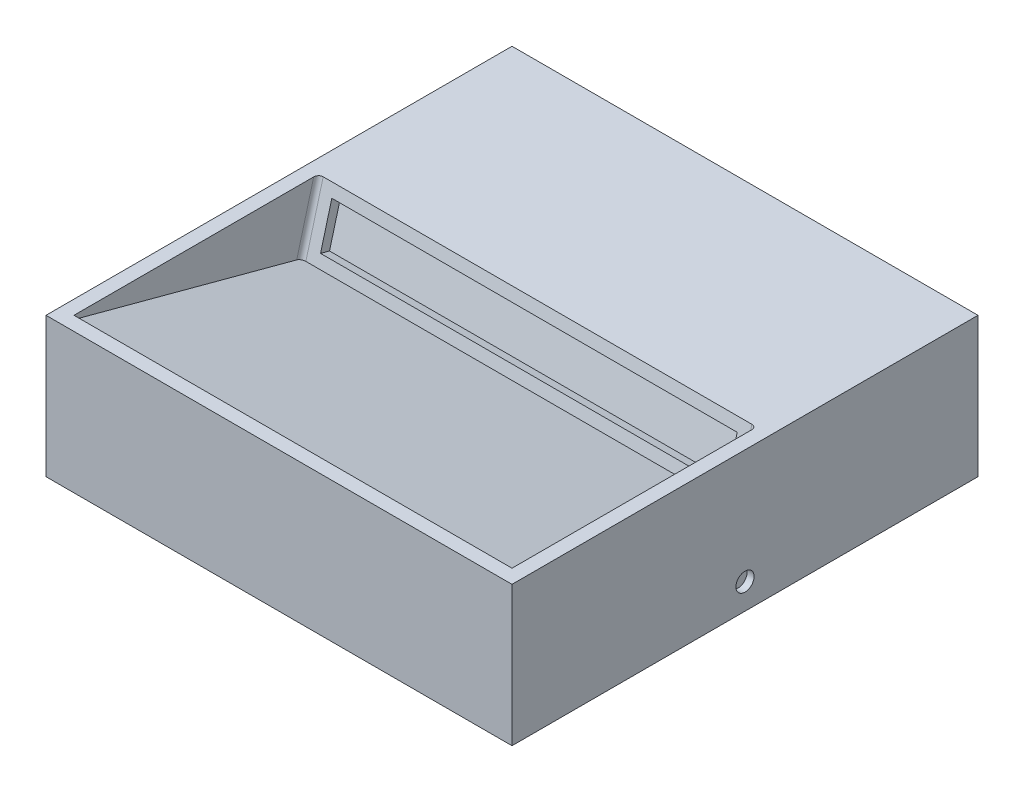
ISO-10303-21;
HEADER;
FILE_DESCRIPTION(('STEP AP214'),'2;1');
FILE_NAME('part.step','',(''),(''),'','','');
FILE_SCHEMA(('AUTOMOTIVE_DESIGN { 1 0 10303 214 1 1 1 1 }'));
ENDSEC;
DATA;
#1=APPLICATION_CONTEXT('core data for automotive mechanical design processes');
#2=APPLICATION_PROTOCOL_DEFINITION('international standard','automotive_design',2000,#1);
#3=PRODUCT_CONTEXT('',#1,'mechanical');
#4=PRODUCT('Part','Part','',(#3));
#5=PRODUCT_RELATED_PRODUCT_CATEGORY('part','',(#4));
#6=PRODUCT_DEFINITION_FORMATION('','',#4);
#7=PRODUCT_DEFINITION_CONTEXT('part definition',#1,'design');
#8=PRODUCT_DEFINITION('design','',#6,#7);
#9=PRODUCT_DEFINITION_SHAPE('','',#8);
#10=(LENGTH_UNIT() NAMED_UNIT(*) SI_UNIT(.MILLI.,.METRE.));
#11=(NAMED_UNIT(*) PLANE_ANGLE_UNIT() SI_UNIT($,.RADIAN.));
#12=(NAMED_UNIT(*) SI_UNIT($,.STERADIAN.) SOLID_ANGLE_UNIT());
#13=UNCERTAINTY_MEASURE_WITH_UNIT(LENGTH_MEASURE(1.E-05),#10,'distance_accuracy_value','');
#14=(GEOMETRIC_REPRESENTATION_CONTEXT(3) GLOBAL_UNCERTAINTY_ASSIGNED_CONTEXT((#13)) GLOBAL_UNIT_ASSIGNED_CONTEXT((#10,
#11,#12)) REPRESENTATION_CONTEXT('',''));
#15=CARTESIAN_POINT('',(0.,0.,0.));
#16=DIRECTION('',(0.,0.,1.));
#17=DIRECTION('',(1.,0.,0.));
#18=AXIS2_PLACEMENT_3D('',#15,#16,#17);
#19=CARTESIAN_POINT('',(100.,30.,-100.));
#20=DIRECTION('',(-1.,0.,0.));
#21=DIRECTION('',(0.,0.,1.));
#22=AXIS2_PLACEMENT_3D('',#19,#20,#21);
#23=PLANE('',#22);
#24=DIRECTION('',(0.,0.,-1.));
#25=VECTOR('',#24,1.);
#26=CARTESIAN_POINT('',(100.,0.,-100.));
#27=LINE('',#26,#25);
#28=CARTESIAN_POINT('',(100.,0.,0.));
#29=VERTEX_POINT('',#28);
#30=CARTESIAN_POINT('',(100.,0.,-100.));
#31=VERTEX_POINT('',#30);
#32=EDGE_CURVE('E546',#29,#31,#27,.T.);
#33=ORIENTED_EDGE('',*,*,#32,.T.);
#34=DIRECTION('',(0.,-1.,0.));
#35=VECTOR('',#34,1.);
#36=CARTESIAN_POINT('',(100.,30.,-100.));
#37=LINE('',#36,#35);
#38=CARTESIAN_POINT('',(100.,30.,-100.));
#39=VERTEX_POINT('',#38);
#40=EDGE_CURVE('E561',#39,#31,#37,.T.);
#41=ORIENTED_EDGE('',*,*,#40,.F.);
#42=DIRECTION('',(0.,0.,-1.));
#43=VECTOR('',#42,1.);
#44=CARTESIAN_POINT('',(100.,30.,-100.));
#45=LINE('',#44,#43);
#46=CARTESIAN_POINT('',(100.,30.,0.));
#47=VERTEX_POINT('',#46);
#48=EDGE_CURVE('E532',#47,#39,#45,.T.);
#49=ORIENTED_EDGE('',*,*,#48,.F.);
#50=DIRECTION('',(0.,-1.,0.));
#51=VECTOR('',#50,1.);
#52=CARTESIAN_POINT('',(100.,30.,0.));
#53=LINE('',#52,#51);
#54=EDGE_CURVE('E565',#47,#29,#53,.T.);
#55=ORIENTED_EDGE('',*,*,#54,.T.);
#56=EDGE_LOOP('',(#33,#41,#49,#55));
#57=FACE_BOUND('',#56,.T.);
#58=CARTESIAN_POINT('',(100.,5.5,-50.));
#59=DIRECTION('',(1.,0.,0.));
#60=DIRECTION('',(0.,0.,-1.));
#61=AXIS2_PLACEMENT_3D('',#58,#59,#60);
#62=CIRCLE('',#61,1.94999999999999);
#63=CARTESIAN_POINT('',(100.,5.5,-51.95));
#64=VERTEX_POINT('',#63);
#65=EDGE_CURVE('E260',#64,#64,#62,.T.);
#66=ORIENTED_EDGE('',*,*,#65,.F.);
#67=EDGE_LOOP('',(#66));
#68=FACE_BOUND('',#67,.T.);
#69=ADVANCED_FACE('F41',(#57,#68),#23,.F.);
#70=CARTESIAN_POINT('',(0.,30.,0.));
#71=DIRECTION('',(1.,0.,0.));
#72=DIRECTION('',(0.,0.,-1.));
#73=AXIS2_PLACEMENT_3D('',#70,#71,#72);
#74=PLANE('',#73);
#75=DIRECTION('',(0.,0.,1.));
#76=VECTOR('',#75,1.);
#77=CARTESIAN_POINT('',(0.,0.,0.));
#78=LINE('',#77,#76);
#79=CARTESIAN_POINT('',(0.,0.,-100.));
#80=VERTEX_POINT('',#79);
#81=CARTESIAN_POINT('',(0.,0.,0.));
#82=VERTEX_POINT('',#81);
#83=EDGE_CURVE('E533',#80,#82,#78,.T.);
#84=ORIENTED_EDGE('',*,*,#83,.T.);
#85=DIRECTION('',(0.,-1.,0.));
#86=VECTOR('',#85,1.);
#87=CARTESIAN_POINT('',(0.,30.,0.));
#88=LINE('',#87,#86);
#89=CARTESIAN_POINT('',(0.,30.,0.));
#90=VERTEX_POINT('',#89);
#91=EDGE_CURVE('E542',#90,#82,#88,.T.);
#92=ORIENTED_EDGE('',*,*,#91,.F.);
#93=DIRECTION('',(0.,0.,1.));
#94=VECTOR('',#93,1.);
#95=CARTESIAN_POINT('',(0.,30.,0.));
#96=LINE('',#95,#94);
#97=CARTESIAN_POINT('',(0.,30.,-100.));
#98=VERTEX_POINT('',#97);
#99=EDGE_CURVE('E539',#98,#90,#96,.T.);
#100=ORIENTED_EDGE('',*,*,#99,.F.);
#101=DIRECTION('',(0.,-1.,0.));
#102=VECTOR('',#101,1.);
#103=CARTESIAN_POINT('',(0.,30.,-100.));
#104=LINE('',#103,#102);
#105=EDGE_CURVE('E557',#98,#80,#104,.T.);
#106=ORIENTED_EDGE('',*,*,#105,.T.);
#107=EDGE_LOOP('',(#84,#92,#100,#106));
#108=FACE_BOUND('',#107,.T.);
#109=CARTESIAN_POINT('',(0.,5.5,-50.));
#110=DIRECTION('',(-1.,0.,0.));
#111=DIRECTION('',(0.,0.,1.));
#112=AXIS2_PLACEMENT_3D('',#109,#110,#111);
#113=CIRCLE('',#112,1.94999999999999);
#114=CARTESIAN_POINT('',(0.,5.5,-48.05));
#115=VERTEX_POINT('',#114);
#116=EDGE_CURVE('E275',#115,#115,#113,.T.);
#117=ORIENTED_EDGE('',*,*,#116,.F.);
#118=EDGE_LOOP('',(#117));
#119=FACE_BOUND('',#118,.T.);
#120=ADVANCED_FACE('F610',(#108,#119),#74,.F.);
#121=CARTESIAN_POINT('',(0.,30.,0.));
#122=DIRECTION('',(0.,-1.,0.));
#123=DIRECTION('',(0.,0.,-1.));
#124=AXIS2_PLACEMENT_3D('',#121,#122,#123);
#125=PLANE('',#124);
#126=DIRECTION('',(1.,0.,0.));
#127=VECTOR('',#126,1.);
#128=CARTESIAN_POINT('',(100.,30.,0.));
#129=LINE('',#128,#127);
#130=EDGE_CURVE('E529',#90,#47,#129,.T.);
#131=ORIENTED_EDGE('',*,*,#130,.T.);
#132=ORIENTED_EDGE('',*,*,#48,.T.);
#133=DIRECTION('',(-1.,0.,0.));
#134=VECTOR('',#133,1.);
#135=CARTESIAN_POINT('',(0.,30.,-100.));
#136=LINE('',#135,#134);
#137=EDGE_CURVE('E536',#39,#98,#136,.T.);
#138=ORIENTED_EDGE('',*,*,#137,.T.);
#139=ORIENTED_EDGE('',*,*,#99,.T.);
#140=EDGE_LOOP('',(#131,#132,#138,#139));
#141=FACE_BOUND('',#140,.T.);
#142=DIRECTION('',(0.,0.,1.));
#143=VECTOR('',#142,1.);
#144=CARTESIAN_POINT('',(3.,30.,0.));
#145=LINE('',#144,#143);
#146=CARTESIAN_POINT('',(3.,30.,-54.4478480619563));
#147=VERTEX_POINT('',#146);
#148=CARTESIAN_POINT('',(3.,30.,-3.));
#149=VERTEX_POINT('',#148);
#150=EDGE_CURVE('E11',#147,#149,#145,.T.);
#151=ORIENTED_EDGE('',*,*,#150,.F.);
#152=CARTESIAN_POINT('',(4.,30.,-54.4478480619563));
#153=DIRECTION('',(0.,-1.,0.));
#154=DIRECTION('',(0.,0.,1.));
#155=AXIS2_PLACEMENT_3D('',#152,#153,#154);
#156=ELLIPSE('',#155,1.03527618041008,0.999999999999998);
#157=CARTESIAN_POINT('',(4.00000000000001,30.,-55.4831242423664));
#158=VERTEX_POINT('',#157);
#159=EDGE_CURVE('E50',#158,#147,#156,.F.);
#160=ORIENTED_EDGE('',*,*,#159,.F.);
#161=DIRECTION('',(1.,0.,0.));
#162=VECTOR('',#161,1.);
#163=CARTESIAN_POINT('',(0.,30.,-55.4831242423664));
#164=LINE('',#163,#162);
#165=CARTESIAN_POINT('',(96.,30.,-55.4831242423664));
#166=VERTEX_POINT('',#165);
#167=EDGE_CURVE('E575',#158,#166,#164,.T.);
#168=ORIENTED_EDGE('',*,*,#167,.T.);
#169=CARTESIAN_POINT('',(96.,30.,-54.4478480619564));
#170=DIRECTION('',(0.,-1.,0.));
#171=DIRECTION('',(0.,0.,1.));
#172=AXIS2_PLACEMENT_3D('',#169,#170,#171);
#173=ELLIPSE('',#172,1.03527618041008,0.999999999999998);
#174=CARTESIAN_POINT('',(97.,30.,-54.4478480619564));
#175=VERTEX_POINT('',#174);
#176=EDGE_CURVE('E569',#175,#166,#173,.F.);
#177=ORIENTED_EDGE('',*,*,#176,.F.);
#178=DIRECTION('',(0.,0.,1.));
#179=VECTOR('',#178,1.);
#180=CARTESIAN_POINT('',(97.,30.,0.));
#181=LINE('',#180,#179);
#182=CARTESIAN_POINT('',(97.,30.,-3.));
#183=VERTEX_POINT('',#182);
#184=EDGE_CURVE('E572',#175,#183,#181,.T.);
#185=ORIENTED_EDGE('',*,*,#184,.T.);
#186=DIRECTION('',(-1.,0.,0.));
#187=VECTOR('',#186,1.);
#188=CARTESIAN_POINT('',(3.,30.,-3.));
#189=LINE('',#188,#187);
#190=EDGE_CURVE('E267',#183,#149,#189,.T.);
#191=ORIENTED_EDGE('',*,*,#190,.T.);
#192=EDGE_LOOP('',(#151,#160,#168,#177,#185,#191));
#193=FACE_BOUND('',#192,.T.);
#194=ADVANCED_FACE('F584',(#141,#193),#125,.F.);
#195=CARTESIAN_POINT('',(100.,30.,0.));
#196=DIRECTION('',(0.,0.,-1.));
#197=DIRECTION('',(-1.,0.,0.));
#198=AXIS2_PLACEMENT_3D('',#195,#196,#197);
#199=PLANE('',#198);
#200=DIRECTION('',(1.,0.,0.));
#201=VECTOR('',#200,1.);
#202=CARTESIAN_POINT('',(100.,0.,0.));
#203=LINE('',#202,#201);
#204=EDGE_CURVE('E528',#82,#29,#203,.T.);
#205=ORIENTED_EDGE('',*,*,#204,.T.);
#206=ORIENTED_EDGE('',*,*,#54,.F.);
#207=ORIENTED_EDGE('',*,*,#130,.F.);
#208=ORIENTED_EDGE('',*,*,#91,.T.);
#209=EDGE_LOOP('',(#205,#206,#207,#208));
#210=FACE_BOUND('',#209,.T.);
#211=ADVANCED_FACE('F43',(#210),#199,.F.);
#212=CARTESIAN_POINT('',(0.,30.,-100.));
#213=DIRECTION('',(0.,0.,1.));
#214=DIRECTION('',(1.,0.,0.));
#215=AXIS2_PLACEMENT_3D('',#212,#213,#214);
#216=PLANE('',#215);
#217=DIRECTION('',(-1.,0.,0.));
#218=VECTOR('',#217,1.);
#219=CARTESIAN_POINT('',(0.,0.,-100.));
#220=LINE('',#219,#218);
#221=EDGE_CURVE('E549',#31,#80,#220,.T.);
#222=ORIENTED_EDGE('',*,*,#221,.T.);
#223=ORIENTED_EDGE('',*,*,#105,.F.);
#224=ORIENTED_EDGE('',*,*,#137,.F.);
#225=ORIENTED_EDGE('',*,*,#40,.T.);
#226=EDGE_LOOP('',(#222,#223,#224,#225));
#227=FACE_BOUND('',#226,.T.);
#228=ADVANCED_FACE('F603',(#227),#216,.F.);
#229=CARTESIAN_POINT('',(0.,0.,0.));
#230=DIRECTION('',(0.,-1.,0.));
#231=DIRECTION('',(0.,0.,-1.));
#232=AXIS2_PLACEMENT_3D('',#229,#230,#231);
#233=PLANE('',#232);
#234=CARTESIAN_POINT('',(96.5,0.,-3.5));
#235=DIRECTION('',(0.,-1.,0.));
#236=DIRECTION('',(0.,0.,-1.));
#237=AXIS2_PLACEMENT_3D('',#234,#235,#236);
#238=CIRCLE('',#237,2.);
#239=CARTESIAN_POINT('',(98.5,0.,-3.5));
#240=VERTEX_POINT('',#239);
#241=CARTESIAN_POINT('',(96.5,0.,-1.5));
#242=VERTEX_POINT('',#241);
#243=EDGE_CURVE('E351',#240,#242,#238,.T.);
#244=ORIENTED_EDGE('',*,*,#243,.F.);
#245=DIRECTION('',(0.,0.,1.));
#246=VECTOR('',#245,1.);
#247=CARTESIAN_POINT('',(98.5,0.,-96.5));
#248=LINE('',#247,#246);
#249=CARTESIAN_POINT('',(98.5,0.,-96.5));
#250=VERTEX_POINT('',#249);
#251=EDGE_CURVE('E378',#250,#240,#248,.T.);
#252=ORIENTED_EDGE('',*,*,#251,.F.);
#253=CARTESIAN_POINT('',(96.5,0.,-96.5));
#254=DIRECTION('',(0.,-1.,0.));
#255=DIRECTION('',(0.,0.,1.));
#256=AXIS2_PLACEMENT_3D('',#253,#254,#255);
#257=CIRCLE('',#256,2.);
#258=CARTESIAN_POINT('',(96.5,0.,-98.5));
#259=VERTEX_POINT('',#258);
#260=EDGE_CURVE('E429',#259,#250,#257,.T.);
#261=ORIENTED_EDGE('',*,*,#260,.F.);
#262=DIRECTION('',(1.,0.,0.));
#263=VECTOR('',#262,1.);
#264=CARTESIAN_POINT('',(3.50000000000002,0.,-98.5));
#265=LINE('',#264,#263);
#266=CARTESIAN_POINT('',(3.5,0.,-98.5));
#267=VERTEX_POINT('',#266);
#268=EDGE_CURVE('E425',#267,#259,#265,.T.);
#269=ORIENTED_EDGE('',*,*,#268,.F.);
#270=CARTESIAN_POINT('',(3.5,0.,-96.5));
#271=DIRECTION('',(0.,-1.,0.));
#272=DIRECTION('',(0.,0.,-1.));
#273=AXIS2_PLACEMENT_3D('',#270,#271,#272);
#274=CIRCLE('',#273,2.);
#275=CARTESIAN_POINT('',(1.5,0.,-96.5));
#276=VERTEX_POINT('',#275);
#277=EDGE_CURVE('E421',#276,#267,#274,.T.);
#278=ORIENTED_EDGE('',*,*,#277,.F.);
#279=DIRECTION('',(0.,0.,-1.));
#280=VECTOR('',#279,1.);
#281=CARTESIAN_POINT('',(1.5,0.,-3.50000000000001));
#282=LINE('',#281,#280);
#283=CARTESIAN_POINT('',(1.5,0.,-3.50000000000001));
#284=VERTEX_POINT('',#283);
#285=EDGE_CURVE('E417',#284,#276,#282,.T.);
#286=ORIENTED_EDGE('',*,*,#285,.F.);
#287=CARTESIAN_POINT('',(3.5,0.,-3.5));
#288=DIRECTION('',(0.,-1.,0.));
#289=DIRECTION('',(0.,0.,1.));
#290=AXIS2_PLACEMENT_3D('',#287,#288,#289);
#291=CIRCLE('',#290,2.);
#292=CARTESIAN_POINT('',(3.5,0.,-1.5));
#293=VERTEX_POINT('',#292);
#294=EDGE_CURVE('E413',#293,#284,#291,.T.);
#295=ORIENTED_EDGE('',*,*,#294,.F.);
#296=DIRECTION('',(-1.,0.,0.));
#297=VECTOR('',#296,1.);
#298=CARTESIAN_POINT('',(96.5,0.,-1.5));
#299=LINE('',#298,#297);
#300=EDGE_CURVE('E409',#242,#293,#299,.T.);
#301=ORIENTED_EDGE('',*,*,#300,.F.);
#302=EDGE_LOOP('',(#244,#252,#261,#269,#278,#286,#295,#301));
#303=FACE_BOUND('',#302,.T.);
#304=ORIENTED_EDGE('',*,*,#204,.F.);
#305=ORIENTED_EDGE('',*,*,#83,.F.);
#306=ORIENTED_EDGE('',*,*,#221,.F.);
#307=ORIENTED_EDGE('',*,*,#32,.F.);
#308=EDGE_LOOP('',(#304,#305,#306,#307));
#309=FACE_BOUND('',#308,.T.);
#310=ADVANCED_FACE('F595',(#303,#309),#233,.T.);
#311=CARTESIAN_POINT('',(0.,48.9706970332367,-60.5663071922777));
#312=DIRECTION('',(0.,-0.258819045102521,-0.965925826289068));
#313=DIRECTION('',(0.,0.965925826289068,-0.258819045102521));
#314=AXIS2_PLACEMENT_3D('',#311,#312,#313);
#315=PLANE('',#314);
#316=DIRECTION('',(0.,-0.965925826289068,0.258819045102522));
#317=VECTOR('',#316,1.);
#318=CARTESIAN_POINT('',(6.50000000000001,27.5851854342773,-54.8360766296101));
#319=LINE('',#318,#317);
#320=CARTESIAN_POINT('',(6.50000000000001,27.5851854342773,-54.8360766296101));
#321=VERTEX_POINT('',#320);
#322=CARTESIAN_POINT('',(6.50000000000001,18.544033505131,-52.4135072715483));
#323=VERTEX_POINT('',#322);
#324=EDGE_CURVE('E481',#321,#323,#319,.T.);
#325=ORIENTED_EDGE('',*,*,#324,.F.);
#326=DIRECTION('',(-1.,0.,0.));
#327=VECTOR('',#326,1.);
#328=CARTESIAN_POINT('',(93.5,27.5851854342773,-54.8360766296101));
#329=LINE('',#328,#327);
#330=CARTESIAN_POINT('',(93.5,27.5851854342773,-54.8360766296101));
#331=VERTEX_POINT('',#330);
#332=EDGE_CURVE('E439',#331,#321,#329,.T.);
#333=ORIENTED_EDGE('',*,*,#332,.F.);
#334=DIRECTION('',(0.,0.965925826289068,-0.258819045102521));
#335=VECTOR('',#334,1.);
#336=CARTESIAN_POINT('',(93.5,18.544033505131,-52.4135072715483));
#337=LINE('',#336,#335);
#338=CARTESIAN_POINT('',(93.5,18.544033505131,-52.4135072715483));
#339=VERTEX_POINT('',#338);
#340=EDGE_CURVE('E466',#339,#331,#337,.T.);
#341=ORIENTED_EDGE('',*,*,#340,.F.);
#342=DIRECTION('',(1.,0.,0.));
#343=VECTOR('',#342,1.);
#344=CARTESIAN_POINT('',(6.50000000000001,18.544033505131,-52.4135072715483));
#345=LINE('',#344,#343);
#346=EDGE_CURVE('E485',#323,#339,#345,.T.);
#347=ORIENTED_EDGE('',*,*,#346,.F.);
#348=EDGE_LOOP('',(#325,#333,#341,#347));
#349=FACE_BOUND('',#348,.T.);
#350=DIRECTION('',(0.,-0.965925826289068,0.258819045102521));
#351=VECTOR('',#350,1.);
#352=CARTESIAN_POINT('',(4.00000000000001,48.9706970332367,-60.5663071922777));
#353=LINE('',#352,#351);
#354=CARTESIAN_POINT('',(4.00000000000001,16.1292189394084,-51.766459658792));
#355=VERTEX_POINT('',#354);
#356=EDGE_CURVE('E525',#158,#355,#353,.T.);
#357=ORIENTED_EDGE('',*,*,#356,.T.);
#358=DIRECTION('',(1.,0.,0.));
#359=VECTOR('',#358,1.);
#360=CARTESIAN_POINT('',(0.,16.1292189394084,-51.766459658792));
#361=LINE('',#360,#359);
#362=CARTESIAN_POINT('',(96.,16.1292189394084,-51.766459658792));
#363=VERTEX_POINT('',#362);
#364=EDGE_CURVE('E495',#355,#363,#361,.T.);
#365=ORIENTED_EDGE('',*,*,#364,.T.);
#366=DIRECTION('',(0.,-0.965925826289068,0.258819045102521));
#367=VECTOR('',#366,1.);
#368=CARTESIAN_POINT('',(96.,48.9706970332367,-60.5663071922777));
#369=LINE('',#368,#367);
#370=EDGE_CURVE('E516',#166,#363,#369,.T.);
#371=ORIENTED_EDGE('',*,*,#370,.F.);
#372=ORIENTED_EDGE('',*,*,#167,.F.);
#373=EDGE_LOOP('',(#357,#365,#371,#372));
#374=FACE_BOUND('',#373,.T.);
#375=ADVANCED_FACE('F593',(#349,#374),#315,.F.);
#376=CARTESIAN_POINT('',(4.,49.2295160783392,-59.6003813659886));
#377=DIRECTION('',(0.,-0.965925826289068,0.258819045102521));
#378=DIRECTION('',(0.,-0.258819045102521,-0.965925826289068));
#379=AXIS2_PLACEMENT_3D('',#376,#377,#378);
#380=CYLINDRICAL_SURFACE('',#379,0.999999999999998);
#381=ORIENTED_EDGE('',*,*,#159,.T.);
#382=DIRECTION('',(0.,-0.965925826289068,0.258819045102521));
#383=VECTOR('',#382,1.);
#384=CARTESIAN_POINT('',(3.,49.2295160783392,-59.6003813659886));
#385=LINE('',#384,#383);
#386=CARTESIAN_POINT('',(3.,16.3880379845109,-50.8005338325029));
#387=VERTEX_POINT('',#386);
#388=EDGE_CURVE('E522',#147,#387,#385,.T.);
#389=ORIENTED_EDGE('',*,*,#388,.T.);
#390=CARTESIAN_POINT('',(4.,16.3880379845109,-50.8005338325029));
#391=DIRECTION('',(0.,0.965925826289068,-0.258819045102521));
#392=DIRECTION('',(0.,0.258819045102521,0.965925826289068));
#393=AXIS2_PLACEMENT_3D('',#390,#391,#392);
#394=CIRCLE('',#393,0.999999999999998);
#395=EDGE_CURVE('E247',#355,#387,#394,.T.);
#396=ORIENTED_EDGE('',*,*,#395,.F.);
#397=ORIENTED_EDGE('',*,*,#356,.F.);
#398=EDGE_LOOP('',(#381,#389,#396,#397));
#399=FACE_BOUND('',#398,.T.);
#400=ADVANCED_FACE('F582',(#399),#380,.F.);
#401=CARTESIAN_POINT('',(3.,60.8318591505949,-16.2998475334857));
#402=DIRECTION('',(1.,0.,0.));
#403=DIRECTION('',(0.,0.,-1.));
#404=AXIS2_PLACEMENT_3D('',#401,#402,#403);
#405=PLANE('',#404);
#406=DIRECTION('',(0.,1.,0.));
#407=VECTOR('',#406,1.);
#408=CARTESIAN_POINT('',(3.,-66.1086085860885,-3.));
#409=LINE('',#408,#407);
#410=CARTESIAN_POINT('',(3.,29.1961524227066,-3.));
#411=VERTEX_POINT('',#410);
#412=EDGE_CURVE('E251',#411,#149,#409,.T.);
#413=ORIENTED_EDGE('',*,*,#412,.F.);
#414=DIRECTION('',(0.,0.258819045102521,0.965925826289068));
#415=VECTOR('',#414,1.);
#416=CARTESIAN_POINT('',(3.,27.9903810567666,-7.50000000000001));
#417=LINE('',#416,#415);
#418=EDGE_CURVE('E240',#387,#411,#417,.T.);
#419=ORIENTED_EDGE('',*,*,#418,.F.);
#420=ORIENTED_EDGE('',*,*,#388,.F.);
#421=ORIENTED_EDGE('',*,*,#150,.T.);
#422=EDGE_LOOP('',(#413,#419,#420,#421));
#423=FACE_BOUND('',#422,.T.);
#424=ADVANCED_FACE('F252',(#423),#405,.T.);
#425=CARTESIAN_POINT('',(97.,60.8318591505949,-16.2998475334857));
#426=DIRECTION('',(1.,0.,0.));
#427=DIRECTION('',(0.,0.,-1.));
#428=AXIS2_PLACEMENT_3D('',#425,#426,#427);
#429=PLANE('',#428);
#430=DIRECTION('',(0.,0.258819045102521,0.965925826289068));
#431=VECTOR('',#430,1.);
#432=CARTESIAN_POINT('',(97.,27.9903810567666,-7.49999999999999));
#433=LINE('',#432,#431);
#434=CARTESIAN_POINT('',(97.,16.3880379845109,-50.8005338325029));
#435=VERTEX_POINT('',#434);
#436=CARTESIAN_POINT('',(97.,29.1961524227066,-3.));
#437=VERTEX_POINT('',#436);
#438=EDGE_CURVE('E249',#435,#437,#433,.T.);
#439=ORIENTED_EDGE('',*,*,#438,.T.);
#440=DIRECTION('',(0.,1.,0.));
#441=VECTOR('',#440,1.);
#442=CARTESIAN_POINT('',(97.,-66.1086085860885,-3.));
#443=LINE('',#442,#441);
#444=EDGE_CURVE('E63',#437,#183,#443,.T.);
#445=ORIENTED_EDGE('',*,*,#444,.T.);
#446=ORIENTED_EDGE('',*,*,#184,.F.);
#447=DIRECTION('',(0.,-0.965925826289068,0.258819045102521));
#448=VECTOR('',#447,1.);
#449=CARTESIAN_POINT('',(97.,49.2295160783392,-59.6003813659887));
#450=LINE('',#449,#448);
#451=EDGE_CURVE('E519',#175,#435,#450,.T.);
#452=ORIENTED_EDGE('',*,*,#451,.T.);
#453=EDGE_LOOP('',(#439,#445,#446,#452));
#454=FACE_BOUND('',#453,.T.);
#455=ADVANCED_FACE('F587',(#454),#429,.F.);
#456=CARTESIAN_POINT('',(96.,49.2295160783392,-59.6003813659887));
#457=DIRECTION('',(0.,-0.965925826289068,0.258819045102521));
#458=DIRECTION('',(0.,-0.258819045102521,-0.965925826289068));
#459=AXIS2_PLACEMENT_3D('',#456,#457,#458);
#460=CYLINDRICAL_SURFACE('',#459,0.999999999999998);
#461=ORIENTED_EDGE('',*,*,#176,.T.);
#462=ORIENTED_EDGE('',*,*,#370,.T.);
#463=CARTESIAN_POINT('',(96.,16.3880379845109,-50.8005338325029));
#464=DIRECTION('',(0.,0.965925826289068,-0.258819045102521));
#465=DIRECTION('',(0.,0.258819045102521,0.965925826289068));
#466=AXIS2_PLACEMENT_3D('',#463,#464,#465);
#467=CIRCLE('',#466,0.999999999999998);
#468=EDGE_CURVE('E512',#435,#363,#467,.T.);
#469=ORIENTED_EDGE('',*,*,#468,.F.);
#470=ORIENTED_EDGE('',*,*,#451,.F.);
#471=EDGE_LOOP('',(#461,#462,#469,#470));
#472=FACE_BOUND('',#471,.T.);
#473=ADVANCED_FACE('F590',(#472),#460,.F.);
#474=CARTESIAN_POINT('',(0.,27.9903810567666,-7.50000000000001));
#475=DIRECTION('',(0.,0.965925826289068,-0.258819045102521));
#476=DIRECTION('',(0.,0.258819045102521,0.965925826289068));
#477=AXIS2_PLACEMENT_3D('',#474,#475,#476);
#478=PLANE('',#477);
#479=DIRECTION('',(1.,0.,0.));
#480=VECTOR('',#479,1.);
#481=CARTESIAN_POINT('',(3.00000000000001,29.1961524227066,-3.));
#482=LINE('',#481,#480);
#483=EDGE_CURVE('E244',#411,#437,#482,.T.);
#484=ORIENTED_EDGE('',*,*,#483,.T.);
#485=ORIENTED_EDGE('',*,*,#438,.F.);
#486=ORIENTED_EDGE('',*,*,#468,.T.);
#487=ORIENTED_EDGE('',*,*,#364,.F.);
#488=ORIENTED_EDGE('',*,*,#395,.T.);
#489=ORIENTED_EDGE('',*,*,#418,.T.);
#490=EDGE_LOOP('',(#484,#485,#486,#487,#488,#489));
#491=FACE_BOUND('',#490,.T.);
#492=ADVANCED_FACE('F241',(#491),#478,.T.);
#493=CARTESIAN_POINT('',(93.5,27.0675473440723,-56.7679282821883));
#494=DIRECTION('',(0.,0.965925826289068,-0.258819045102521));
#495=DIRECTION('',(0.,0.258819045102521,0.965925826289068));
#496=AXIS2_PLACEMENT_3D('',#493,#494,#495);
#497=PLANE('',#496);
#498=ORIENTED_EDGE('',*,*,#332,.T.);
#499=DIRECTION('',(0.,0.258819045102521,0.965925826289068));
#500=VECTOR('',#499,1.);
#501=CARTESIAN_POINT('',(6.50000000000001,27.0675473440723,-56.7679282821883));
#502=LINE('',#501,#500);
#503=CARTESIAN_POINT('',(6.50000000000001,27.0675473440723,-56.7679282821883));
#504=VERTEX_POINT('',#503);
#505=EDGE_CURVE('E478',#504,#321,#502,.T.);
#506=ORIENTED_EDGE('',*,*,#505,.F.);
#507=DIRECTION('',(-1.,0.,0.));
#508=VECTOR('',#507,1.);
#509=CARTESIAN_POINT('',(93.5,27.0675473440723,-56.7679282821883));
#510=LINE('',#509,#508);
#511=CARTESIAN_POINT('',(93.5,27.0675473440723,-56.7679282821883));
#512=VERTEX_POINT('',#511);
#513=EDGE_CURVE('E461',#512,#504,#510,.T.);
#514=ORIENTED_EDGE('',*,*,#513,.F.);
#515=DIRECTION('',(0.,0.258819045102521,0.965925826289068));
#516=VECTOR('',#515,1.);
#517=CARTESIAN_POINT('',(93.5,27.0675473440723,-56.7679282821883));
#518=LINE('',#517,#516);
#519=EDGE_CURVE('E492',#512,#331,#518,.T.);
#520=ORIENTED_EDGE('',*,*,#519,.T.);
#521=EDGE_LOOP('',(#498,#506,#514,#520));
#522=FACE_BOUND('',#521,.T.);
#523=ADVANCED_FACE('F735',(#522),#497,.F.);
#524=CARTESIAN_POINT('',(93.5,18.026395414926,-54.3453589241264));
#525=DIRECTION('',(1.,0.,0.));
#526=DIRECTION('',(0.,0.,-1.));
#527=AXIS2_PLACEMENT_3D('',#524,#525,#526);
#528=PLANE('',#527);
#529=ORIENTED_EDGE('',*,*,#340,.T.);
#530=ORIENTED_EDGE('',*,*,#519,.F.);
#531=DIRECTION('',(0.,0.965925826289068,-0.258819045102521));
#532=VECTOR('',#531,1.);
#533=CARTESIAN_POINT('',(93.5,18.026395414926,-54.3453589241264));
#534=LINE('',#533,#532);
#535=CARTESIAN_POINT('',(93.5,18.026395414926,-54.3453589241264));
#536=VERTEX_POINT('',#535);
#537=EDGE_CURVE('E474',#536,#512,#534,.T.);
#538=ORIENTED_EDGE('',*,*,#537,.F.);
#539=DIRECTION('',(0.,0.258819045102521,0.965925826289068));
#540=VECTOR('',#539,1.);
#541=CARTESIAN_POINT('',(93.5,18.026395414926,-54.3453589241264));
#542=LINE('',#541,#540);
#543=EDGE_CURVE('E496',#536,#339,#542,.T.);
#544=ORIENTED_EDGE('',*,*,#543,.T.);
#545=EDGE_LOOP('',(#529,#530,#538,#544));
#546=FACE_BOUND('',#545,.T.);
#547=ADVANCED_FACE('F731',(#546),#528,.F.);
#548=CARTESIAN_POINT('',(6.50000000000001,18.026395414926,-54.3453589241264));
#549=DIRECTION('',(0.,-0.965925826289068,0.258819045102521));
#550=DIRECTION('',(0.,-0.258819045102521,-0.965925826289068));
#551=AXIS2_PLACEMENT_3D('',#548,#549,#550);
#552=PLANE('',#551);
#553=ORIENTED_EDGE('',*,*,#346,.T.);
#554=ORIENTED_EDGE('',*,*,#543,.F.);
#555=DIRECTION('',(1.,0.,0.));
#556=VECTOR('',#555,1.);
#557=CARTESIAN_POINT('',(6.50000000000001,18.026395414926,-54.3453589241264));
#558=LINE('',#557,#556);
#559=CARTESIAN_POINT('',(6.50000000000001,18.026395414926,-54.3453589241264));
#560=VERTEX_POINT('',#559);
#561=EDGE_CURVE('E470',#560,#536,#558,.T.);
#562=ORIENTED_EDGE('',*,*,#561,.F.);
#563=DIRECTION('',(0.,0.258819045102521,0.965925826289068));
#564=VECTOR('',#563,1.);
#565=CARTESIAN_POINT('',(6.50000000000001,18.026395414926,-54.3453589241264));
#566=LINE('',#565,#564);
#567=EDGE_CURVE('E499',#560,#323,#566,.T.);
#568=ORIENTED_EDGE('',*,*,#567,.T.);
#569=EDGE_LOOP('',(#553,#554,#562,#568));
#570=FACE_BOUND('',#569,.T.);
#571=ADVANCED_FACE('F734',(#570),#552,.F.);
#572=CARTESIAN_POINT('',(6.50000000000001,27.0675473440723,-56.7679282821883));
#573=DIRECTION('',(-1.,0.,0.));
#574=DIRECTION('',(0.,-1.,0.));
#575=AXIS2_PLACEMENT_3D('',#572,#573,#574);
#576=PLANE('',#575);
#577=ORIENTED_EDGE('',*,*,#324,.T.);
#578=ORIENTED_EDGE('',*,*,#567,.F.);
#579=DIRECTION('',(0.,-0.965925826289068,0.258819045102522));
#580=VECTOR('',#579,1.);
#581=CARTESIAN_POINT('',(6.50000000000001,27.0675473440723,-56.7679282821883));
#582=LINE('',#581,#580);
#583=EDGE_CURVE('E465',#504,#560,#582,.T.);
#584=ORIENTED_EDGE('',*,*,#583,.F.);
#585=ORIENTED_EDGE('',*,*,#505,.T.);
#586=EDGE_LOOP('',(#577,#578,#584,#585));
#587=FACE_BOUND('',#586,.T.);
#588=ADVANCED_FACE('F729',(#587),#576,.F.);
#589=CARTESIAN_POINT('',(0.,-12.3788002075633,-46.1983113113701));
#590=DIRECTION('',(0.,0.258819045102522,0.965925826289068));
#591=DIRECTION('',(0.,-0.965925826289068,0.258819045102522));
#592=AXIS2_PLACEMENT_3D('',#589,#590,#591);
#593=PLANE('',#592);
#594=ORIENTED_EDGE('',*,*,#513,.T.);
#595=ORIENTED_EDGE('',*,*,#583,.T.);
#596=ORIENTED_EDGE('',*,*,#561,.T.);
#597=ORIENTED_EDGE('',*,*,#537,.T.);
#598=EDGE_LOOP('',(#594,#595,#596,#597));
#599=FACE_BOUND('',#598,.T.);
#600=ADVANCED_FACE('F725',(#599),#593,.T.);
#601=CARTESIAN_POINT('',(96.5,15.,-3.5));
#602=DIRECTION('',(0.,-1.,0.));
#603=DIRECTION('',(0.,0.,-1.));
#604=AXIS2_PLACEMENT_3D('',#601,#602,#603);
#605=CYLINDRICAL_SURFACE('',#604,2.);
#606=ORIENTED_EDGE('',*,*,#243,.T.);
#607=DIRECTION('',(0.,-1.,0.));
#608=VECTOR('',#607,1.);
#609=CARTESIAN_POINT('',(96.5,15.,-1.5));
#610=LINE('',#609,#608);
#611=CARTESIAN_POINT('',(96.5,15.,-1.5));
#612=VERTEX_POINT('',#611);
#613=EDGE_CURVE('E406',#612,#242,#610,.T.);
#614=ORIENTED_EDGE('',*,*,#613,.F.);
#615=CARTESIAN_POINT('',(96.5,15.,-3.5));
#616=DIRECTION('',(0.,-1.,0.));
#617=DIRECTION('',(0.,0.,-1.));
#618=AXIS2_PLACEMENT_3D('',#615,#616,#617);
#619=CIRCLE('',#618,2.);
#620=CARTESIAN_POINT('',(98.5,15.,-3.5));
#621=VERTEX_POINT('',#620);
#622=EDGE_CURVE('E373',#621,#612,#619,.T.);
#623=ORIENTED_EDGE('',*,*,#622,.F.);
#624=DIRECTION('',(0.,-1.,0.));
#625=VECTOR('',#624,1.);
#626=CARTESIAN_POINT('',(98.5,15.,-3.5));
#627=LINE('',#626,#625);
#628=EDGE_CURVE('E436',#621,#240,#627,.T.);
#629=ORIENTED_EDGE('',*,*,#628,.T.);
#630=EDGE_LOOP('',(#606,#614,#623,#629));
#631=FACE_BOUND('',#630,.T.);
#632=ADVANCED_FACE('F699',(#631),#605,.F.);
#633=CARTESIAN_POINT('',(98.5,15.,-96.5));
#634=DIRECTION('',(1.,0.,0.));
#635=DIRECTION('',(0.,0.,-1.));
#636=AXIS2_PLACEMENT_3D('',#633,#634,#635);
#637=PLANE('',#636);
#638=CARTESIAN_POINT('',(98.5,5.5,-50.));
#639=DIRECTION('',(1.,0.,0.));
#640=DIRECTION('',(0.,0.,-1.));
#641=AXIS2_PLACEMENT_3D('',#638,#639,#640);
#642=CIRCLE('',#641,1.94999999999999);
#643=CARTESIAN_POINT('',(98.5,5.5,-51.95));
#644=VERTEX_POINT('',#643);
#645=EDGE_CURVE('E264',#644,#644,#642,.T.);
#646=ORIENTED_EDGE('',*,*,#645,.T.);
#647=EDGE_LOOP('',(#646));
#648=FACE_BOUND('',#647,.T.);
#649=ORIENTED_EDGE('',*,*,#251,.T.);
#650=ORIENTED_EDGE('',*,*,#628,.F.);
#651=DIRECTION('',(0.,0.,1.));
#652=VECTOR('',#651,1.);
#653=CARTESIAN_POINT('',(98.5,15.,-96.5));
#654=LINE('',#653,#652);
#655=CARTESIAN_POINT('',(98.5,15.,-96.5));
#656=VERTEX_POINT('',#655);
#657=EDGE_CURVE('E402',#656,#621,#654,.T.);
#658=ORIENTED_EDGE('',*,*,#657,.F.);
#659=DIRECTION('',(0.,-1.,0.));
#660=VECTOR('',#659,1.);
#661=CARTESIAN_POINT('',(98.5,15.,-96.5));
#662=LINE('',#661,#660);
#663=EDGE_CURVE('E440',#656,#250,#662,.T.);
#664=ORIENTED_EDGE('',*,*,#663,.T.);
#665=EDGE_LOOP('',(#649,#650,#658,#664));
#666=FACE_BOUND('',#665,.T.);
#667=ADVANCED_FACE('F695',(#648,#666),#637,.F.);
#668=CARTESIAN_POINT('',(96.5,15.,-96.5));
#669=DIRECTION('',(0.,-1.,0.));
#670=DIRECTION('',(0.,0.,-1.));
#671=AXIS2_PLACEMENT_3D('',#668,#669,#670);
#672=CYLINDRICAL_SURFACE('',#671,2.);
#673=ORIENTED_EDGE('',*,*,#260,.T.);
#674=ORIENTED_EDGE('',*,*,#663,.F.);
#675=CARTESIAN_POINT('',(96.5,15.,-96.5));
#676=DIRECTION('',(0.,-1.,0.));
#677=DIRECTION('',(0.,0.,1.));
#678=AXIS2_PLACEMENT_3D('',#675,#676,#677);
#679=CIRCLE('',#678,2.);
#680=CARTESIAN_POINT('',(96.5,15.,-98.5));
#681=VERTEX_POINT('',#680);
#682=EDGE_CURVE('E398',#681,#656,#679,.T.);
#683=ORIENTED_EDGE('',*,*,#682,.F.);
#684=DIRECTION('',(0.,-1.,0.));
#685=VECTOR('',#684,1.);
#686=CARTESIAN_POINT('',(96.5,15.,-98.5));
#687=LINE('',#686,#685);
#688=EDGE_CURVE('E443',#681,#259,#687,.T.);
#689=ORIENTED_EDGE('',*,*,#688,.T.);
#690=EDGE_LOOP('',(#673,#674,#683,#689));
#691=FACE_BOUND('',#690,.T.);
#692=ADVANCED_FACE('F698',(#691),#672,.F.);
#693=CARTESIAN_POINT('',(3.50000000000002,15.,-98.5));
#694=DIRECTION('',(0.,0.,-1.));
#695=DIRECTION('',(-1.,0.,0.));
#696=AXIS2_PLACEMENT_3D('',#693,#694,#695);
#697=PLANE('',#696);
#698=ORIENTED_EDGE('',*,*,#268,.T.);
#699=ORIENTED_EDGE('',*,*,#688,.F.);
#700=DIRECTION('',(1.,0.,0.));
#701=VECTOR('',#700,1.);
#702=CARTESIAN_POINT('',(3.50000000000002,15.,-98.5));
#703=LINE('',#702,#701);
#704=CARTESIAN_POINT('',(3.5,15.,-98.5));
#705=VERTEX_POINT('',#704);
#706=EDGE_CURVE('E394',#705,#681,#703,.T.);
#707=ORIENTED_EDGE('',*,*,#706,.F.);
#708=DIRECTION('',(0.,-1.,0.));
#709=VECTOR('',#708,1.);
#710=CARTESIAN_POINT('',(3.5,15.,-98.5));
#711=LINE('',#710,#709);
#712=EDGE_CURVE('E446',#705,#267,#711,.T.);
#713=ORIENTED_EDGE('',*,*,#712,.T.);
#714=EDGE_LOOP('',(#698,#699,#707,#713));
#715=FACE_BOUND('',#714,.T.);
#716=ADVANCED_FACE('F703',(#715),#697,.F.);
#717=CARTESIAN_POINT('',(3.5,15.,-96.5));
#718=DIRECTION('',(0.,-1.,0.));
#719=DIRECTION('',(0.,0.,-1.));
#720=AXIS2_PLACEMENT_3D('',#717,#718,#719);
#721=CYLINDRICAL_SURFACE('',#720,2.);
#722=ORIENTED_EDGE('',*,*,#277,.T.);
#723=ORIENTED_EDGE('',*,*,#712,.F.);
#724=CARTESIAN_POINT('',(3.5,15.,-96.5));
#725=DIRECTION('',(0.,-1.,0.));
#726=DIRECTION('',(0.,0.,-1.));
#727=AXIS2_PLACEMENT_3D('',#724,#725,#726);
#728=CIRCLE('',#727,2.);
#729=CARTESIAN_POINT('',(1.5,15.,-96.5));
#730=VERTEX_POINT('',#729);
#731=EDGE_CURVE('E390',#730,#705,#728,.T.);
#732=ORIENTED_EDGE('',*,*,#731,.F.);
#733=DIRECTION('',(0.,-1.,0.));
#734=VECTOR('',#733,1.);
#735=CARTESIAN_POINT('',(1.5,15.,-96.5));
#736=LINE('',#735,#734);
#737=EDGE_CURVE('E449',#730,#276,#736,.T.);
#738=ORIENTED_EDGE('',*,*,#737,.T.);
#739=EDGE_LOOP('',(#722,#723,#732,#738));
#740=FACE_BOUND('',#739,.T.);
#741=ADVANCED_FACE('F707',(#740),#721,.F.);
#742=CARTESIAN_POINT('',(1.5,15.,-3.50000000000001));
#743=DIRECTION('',(-1.,0.,0.));
#744=DIRECTION('',(0.,0.,1.));
#745=AXIS2_PLACEMENT_3D('',#742,#743,#744);
#746=PLANE('',#745);
#747=CARTESIAN_POINT('',(1.5,5.5,-50.));
#748=DIRECTION('',(-1.,0.,0.));
#749=DIRECTION('',(0.,0.,1.));
#750=AXIS2_PLACEMENT_3D('',#747,#748,#749);
#751=CIRCLE('',#750,1.94999999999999);
#752=CARTESIAN_POINT('',(1.5,5.5,-48.05));
#753=VERTEX_POINT('',#752);
#754=EDGE_CURVE('E279',#753,#753,#751,.T.);
#755=ORIENTED_EDGE('',*,*,#754,.T.);
#756=EDGE_LOOP('',(#755));
#757=FACE_BOUND('',#756,.T.);
#758=ORIENTED_EDGE('',*,*,#285,.T.);
#759=ORIENTED_EDGE('',*,*,#737,.F.);
#760=DIRECTION('',(0.,0.,-1.));
#761=VECTOR('',#760,1.);
#762=CARTESIAN_POINT('',(1.5,15.,-3.50000000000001));
#763=LINE('',#762,#761);
#764=CARTESIAN_POINT('',(1.5,15.,-3.50000000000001));
#765=VERTEX_POINT('',#764);
#766=EDGE_CURVE('E386',#765,#730,#763,.T.);
#767=ORIENTED_EDGE('',*,*,#766,.F.);
#768=DIRECTION('',(0.,-1.,0.));
#769=VECTOR('',#768,1.);
#770=CARTESIAN_POINT('',(1.5,15.,-3.50000000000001));
#771=LINE('',#770,#769);
#772=EDGE_CURVE('E452',#765,#284,#771,.T.);
#773=ORIENTED_EDGE('',*,*,#772,.T.);
#774=EDGE_LOOP('',(#758,#759,#767,#773));
#775=FACE_BOUND('',#774,.T.);
#776=ADVANCED_FACE('F711',(#757,#775),#746,.F.);
#777=CARTESIAN_POINT('',(3.5,15.,-3.5));
#778=DIRECTION('',(0.,-1.,0.));
#779=DIRECTION('',(0.,0.,-1.));
#780=AXIS2_PLACEMENT_3D('',#777,#778,#779);
#781=CYLINDRICAL_SURFACE('',#780,2.);
#782=ORIENTED_EDGE('',*,*,#294,.T.);
#783=ORIENTED_EDGE('',*,*,#772,.F.);
#784=CARTESIAN_POINT('',(3.5,15.,-3.5));
#785=DIRECTION('',(0.,-1.,0.));
#786=DIRECTION('',(0.,0.,1.));
#787=AXIS2_PLACEMENT_3D('',#784,#785,#786);
#788=CIRCLE('',#787,2.);
#789=CARTESIAN_POINT('',(3.5,15.,-1.5));
#790=VERTEX_POINT('',#789);
#791=EDGE_CURVE('E382',#790,#765,#788,.T.);
#792=ORIENTED_EDGE('',*,*,#791,.F.);
#793=DIRECTION('',(0.,-1.,0.));
#794=VECTOR('',#793,1.);
#795=CARTESIAN_POINT('',(3.5,15.,-1.5));
#796=LINE('',#795,#794);
#797=EDGE_CURVE('E455',#790,#293,#796,.T.);
#798=ORIENTED_EDGE('',*,*,#797,.T.);
#799=EDGE_LOOP('',(#782,#783,#792,#798));
#800=FACE_BOUND('',#799,.T.);
#801=ADVANCED_FACE('F715',(#800),#781,.F.);
#802=CARTESIAN_POINT('',(96.5,15.,-1.5));
#803=DIRECTION('',(0.,0.,1.));
#804=DIRECTION('',(1.,0.,0.));
#805=AXIS2_PLACEMENT_3D('',#802,#803,#804);
#806=PLANE('',#805);
#807=ORIENTED_EDGE('',*,*,#300,.T.);
#808=ORIENTED_EDGE('',*,*,#797,.F.);
#809=DIRECTION('',(-1.,0.,0.));
#810=VECTOR('',#809,1.);
#811=CARTESIAN_POINT('',(96.5,15.,-1.5));
#812=LINE('',#811,#810);
#813=EDGE_CURVE('E377',#612,#790,#812,.T.);
#814=ORIENTED_EDGE('',*,*,#813,.F.);
#815=ORIENTED_EDGE('',*,*,#613,.T.);
#816=EDGE_LOOP('',(#807,#808,#814,#815));
#817=FACE_BOUND('',#816,.T.);
#818=ADVANCED_FACE('F693',(#817),#806,.F.);
#819=CARTESIAN_POINT('',(96.5,15.,-3.5));
#820=DIRECTION('',(0.,-1.,0.));
#821=DIRECTION('',(0.,0.,-1.));
#822=AXIS2_PLACEMENT_3D('',#819,#820,#821);
#823=PLANE('',#822);
#824=DIRECTION('',(0.,0.,-1.));
#825=VECTOR('',#824,1.);
#826=CARTESIAN_POINT('',(2.5,15.,-3.50000000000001));
#827=LINE('',#826,#825);
#828=CARTESIAN_POINT('',(2.5,15.,-3.50000000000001));
#829=VERTEX_POINT('',#828);
#830=CARTESIAN_POINT('',(2.5,15.,-96.5));
#831=VERTEX_POINT('',#830);
#832=EDGE_CURVE('E313',#829,#831,#827,.T.);
#833=ORIENTED_EDGE('',*,*,#832,.F.);
#834=CARTESIAN_POINT('',(3.5,15.,-3.5));
#835=DIRECTION('',(0.,-1.,0.));
#836=DIRECTION('',(0.,0.,1.));
#837=AXIS2_PLACEMENT_3D('',#834,#835,#836);
#838=CIRCLE('',#837,1.);
#839=CARTESIAN_POINT('',(3.5,15.,-2.5));
#840=VERTEX_POINT('',#839);
#841=EDGE_CURVE('E309',#840,#829,#838,.T.);
#842=ORIENTED_EDGE('',*,*,#841,.F.);
#843=DIRECTION('',(-1.,0.,0.));
#844=VECTOR('',#843,1.);
#845=CARTESIAN_POINT('',(96.5,15.,-2.5));
#846=LINE('',#845,#844);
#847=CARTESIAN_POINT('',(96.5,15.,-2.5));
#848=VERTEX_POINT('',#847);
#849=EDGE_CURVE('E305',#848,#840,#846,.T.);
#850=ORIENTED_EDGE('',*,*,#849,.F.);
#851=CARTESIAN_POINT('',(96.5,15.,-3.5));
#852=DIRECTION('',(0.,-1.,0.));
#853=DIRECTION('',(0.,0.,-1.));
#854=AXIS2_PLACEMENT_3D('',#851,#852,#853);
#855=CIRCLE('',#854,1.);
#856=CARTESIAN_POINT('',(97.5,15.,-3.50000000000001));
#857=VERTEX_POINT('',#856);
#858=EDGE_CURVE('E301',#857,#848,#855,.T.);
#859=ORIENTED_EDGE('',*,*,#858,.F.);
#860=DIRECTION('',(0.,0.,1.));
#861=VECTOR('',#860,1.);
#862=CARTESIAN_POINT('',(97.5,15.,-96.5));
#863=LINE('',#862,#861);
#864=CARTESIAN_POINT('',(97.5,15.,-96.5));
#865=VERTEX_POINT('',#864);
#866=EDGE_CURVE('E297',#865,#857,#863,.T.);
#867=ORIENTED_EDGE('',*,*,#866,.F.);
#868=CARTESIAN_POINT('',(96.5,15.,-96.5));
#869=DIRECTION('',(0.,-1.,0.));
#870=DIRECTION('',(0.,0.,1.));
#871=AXIS2_PLACEMENT_3D('',#868,#869,#870);
#872=CIRCLE('',#871,1.);
#873=CARTESIAN_POINT('',(96.5,15.,-97.5));
#874=VERTEX_POINT('',#873);
#875=EDGE_CURVE('E293',#874,#865,#872,.T.);
#876=ORIENTED_EDGE('',*,*,#875,.F.);
#877=DIRECTION('',(1.,0.,0.));
#878=VECTOR('',#877,1.);
#879=CARTESIAN_POINT('',(3.50000000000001,15.,-97.5));
#880=LINE('',#879,#878);
#881=CARTESIAN_POINT('',(3.50000000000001,15.,-97.5));
#882=VERTEX_POINT('',#881);
#883=EDGE_CURVE('E288',#882,#874,#880,.T.);
#884=ORIENTED_EDGE('',*,*,#883,.F.);
#885=CARTESIAN_POINT('',(3.5,15.,-96.5));
#886=DIRECTION('',(0.,-1.,0.));
#887=DIRECTION('',(0.,0.,-1.));
#888=AXIS2_PLACEMENT_3D('',#885,#886,#887);
#889=CIRCLE('',#888,1.);
#890=EDGE_CURVE('E284',#831,#882,#889,.T.);
#891=ORIENTED_EDGE('',*,*,#890,.F.);
#892=EDGE_LOOP('',(#833,#842,#850,#859,#867,#876,#884,#891));
#893=FACE_BOUND('',#892,.T.);
#894=ORIENTED_EDGE('',*,*,#622,.T.);
#895=ORIENTED_EDGE('',*,*,#813,.T.);
#896=ORIENTED_EDGE('',*,*,#791,.T.);
#897=ORIENTED_EDGE('',*,*,#766,.T.);
#898=ORIENTED_EDGE('',*,*,#731,.T.);
#899=ORIENTED_EDGE('',*,*,#706,.T.);
#900=ORIENTED_EDGE('',*,*,#682,.T.);
#901=ORIENTED_EDGE('',*,*,#657,.T.);
#902=EDGE_LOOP('',(#894,#895,#896,#897,#898,#899,#900,#901));
#903=FACE_BOUND('',#902,.T.);
#904=ADVANCED_FACE('F689',(#893,#903),#823,.T.);
#905=CARTESIAN_POINT('',(3.5,15.,-96.5));
#906=DIRECTION('',(0.,-1.,0.));
#907=DIRECTION('',(0.,0.,-1.));
#908=AXIS2_PLACEMENT_3D('',#905,#906,#907);
#909=CYLINDRICAL_SURFACE('',#908,1.);
#910=CARTESIAN_POINT('',(3.5,0.,-96.5));
#911=DIRECTION('',(0.,-1.,0.));
#912=DIRECTION('',(0.,0.,-1.));
#913=AXIS2_PLACEMENT_3D('',#910,#911,#912);
#914=CIRCLE('',#913,1.);
#915=CARTESIAN_POINT('',(2.5,0.,-96.5));
#916=VERTEX_POINT('',#915);
#917=CARTESIAN_POINT('',(3.5,0.,-97.5));
#918=VERTEX_POINT('',#917);
#919=EDGE_CURVE('E283',#916,#918,#914,.T.);
#920=ORIENTED_EDGE('',*,*,#919,.F.);
#921=DIRECTION('',(0.,-1.,0.));
#922=VECTOR('',#921,1.);
#923=CARTESIAN_POINT('',(2.5,15.,-96.5));
#924=LINE('',#923,#922);
#925=EDGE_CURVE('E348',#831,#916,#924,.T.);
#926=ORIENTED_EDGE('',*,*,#925,.F.);
#927=ORIENTED_EDGE('',*,*,#890,.T.);
#928=DIRECTION('',(0.,-1.,0.));
#929=VECTOR('',#928,1.);
#930=CARTESIAN_POINT('',(3.50000000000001,15.,-97.5));
#931=LINE('',#930,#929);
#932=EDGE_CURVE('E317',#882,#918,#931,.T.);
#933=ORIENTED_EDGE('',*,*,#932,.T.);
#934=EDGE_LOOP('',(#920,#926,#927,#933));
#935=FACE_BOUND('',#934,.T.);
#936=ADVANCED_FACE('F663',(#935),#909,.T.);
#937=CARTESIAN_POINT('',(2.5,15.,-3.50000000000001));
#938=DIRECTION('',(-1.,0.,0.));
#939=DIRECTION('',(0.,0.,1.));
#940=AXIS2_PLACEMENT_3D('',#937,#938,#939);
#941=PLANE('',#940);
#942=DIRECTION('',(0.,0.,-1.));
#943=VECTOR('',#942,1.);
#944=CARTESIAN_POINT('',(2.5,0.,-3.50000000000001));
#945=LINE('',#944,#943);
#946=CARTESIAN_POINT('',(2.5,0.,-3.50000000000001));
#947=VERTEX_POINT('',#946);
#948=EDGE_CURVE('E289',#947,#916,#945,.T.);
#949=ORIENTED_EDGE('',*,*,#948,.F.);
#950=DIRECTION('',(0.,-1.,0.));
#951=VECTOR('',#950,1.);
#952=CARTESIAN_POINT('',(2.5,15.,-3.50000000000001));
#953=LINE('',#952,#951);
#954=EDGE_CURVE('E352',#829,#947,#953,.T.);
#955=ORIENTED_EDGE('',*,*,#954,.F.);
#956=ORIENTED_EDGE('',*,*,#832,.T.);
#957=ORIENTED_EDGE('',*,*,#925,.T.);
#958=EDGE_LOOP('',(#949,#955,#956,#957));
#959=FACE_BOUND('',#958,.T.);
#960=ADVANCED_FACE('F659',(#959),#941,.T.);
#961=CARTESIAN_POINT('',(3.5,15.,-3.5));
#962=DIRECTION('',(0.,-1.,0.));
#963=DIRECTION('',(0.,0.,-1.));
#964=AXIS2_PLACEMENT_3D('',#961,#962,#963);
#965=CYLINDRICAL_SURFACE('',#964,1.);
#966=CARTESIAN_POINT('',(3.5,0.,-3.5));
#967=DIRECTION('',(0.,-1.,0.));
#968=DIRECTION('',(0.,0.,1.));
#969=AXIS2_PLACEMENT_3D('',#966,#967,#968);
#970=CIRCLE('',#969,1.);
#971=CARTESIAN_POINT('',(3.5,0.,-2.5));
#972=VERTEX_POINT('',#971);
#973=EDGE_CURVE('E341',#972,#947,#970,.T.);
#974=ORIENTED_EDGE('',*,*,#973,.F.);
#975=DIRECTION('',(0.,-1.,0.));
#976=VECTOR('',#975,1.);
#977=CARTESIAN_POINT('',(3.5,15.,-2.5));
#978=LINE('',#977,#976);
#979=EDGE_CURVE('E355',#840,#972,#978,.T.);
#980=ORIENTED_EDGE('',*,*,#979,.F.);
#981=ORIENTED_EDGE('',*,*,#841,.T.);
#982=ORIENTED_EDGE('',*,*,#954,.T.);
#983=EDGE_LOOP('',(#974,#980,#981,#982));
#984=FACE_BOUND('',#983,.T.);
#985=ADVANCED_FACE('F662',(#984),#965,.T.);
#986=CARTESIAN_POINT('',(96.5,15.,-2.5));
#987=DIRECTION('',(0.,0.,1.));
#988=DIRECTION('',(1.,0.,0.));
#989=AXIS2_PLACEMENT_3D('',#986,#987,#988);
#990=PLANE('',#989);
#991=DIRECTION('',(-1.,0.,0.));
#992=VECTOR('',#991,1.);
#993=CARTESIAN_POINT('',(96.5,0.,-2.5));
#994=LINE('',#993,#992);
#995=CARTESIAN_POINT('',(96.5,0.,-2.5));
#996=VERTEX_POINT('',#995);
#997=EDGE_CURVE('E337',#996,#972,#994,.T.);
#998=ORIENTED_EDGE('',*,*,#997,.F.);
#999=DIRECTION('',(0.,-1.,0.));
#1000=VECTOR('',#999,1.);
#1001=CARTESIAN_POINT('',(96.5,15.,-2.5));
#1002=LINE('',#1001,#1000);
#1003=EDGE_CURVE('E358',#848,#996,#1002,.T.);
#1004=ORIENTED_EDGE('',*,*,#1003,.F.);
#1005=ORIENTED_EDGE('',*,*,#849,.T.);
#1006=ORIENTED_EDGE('',*,*,#979,.T.);
#1007=EDGE_LOOP('',(#998,#1004,#1005,#1006));
#1008=FACE_BOUND('',#1007,.T.);
#1009=ADVANCED_FACE('F667',(#1008),#990,.T.);
#1010=CARTESIAN_POINT('',(96.5,15.,-3.5));
#1011=DIRECTION('',(0.,-1.,0.));
#1012=DIRECTION('',(0.,0.,-1.));
#1013=AXIS2_PLACEMENT_3D('',#1010,#1011,#1012);
#1014=CYLINDRICAL_SURFACE('',#1013,1.);
#1015=CARTESIAN_POINT('',(96.5,0.,-3.5));
#1016=DIRECTION('',(0.,-1.,0.));
#1017=DIRECTION('',(0.,0.,-1.));
#1018=AXIS2_PLACEMENT_3D('',#1015,#1016,#1017);
#1019=CIRCLE('',#1018,1.);
#1020=CARTESIAN_POINT('',(97.5,0.,-3.50000000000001));
#1021=VERTEX_POINT('',#1020);
#1022=EDGE_CURVE('E333',#1021,#996,#1019,.T.);
#1023=ORIENTED_EDGE('',*,*,#1022,.F.);
#1024=DIRECTION('',(0.,-1.,0.));
#1025=VECTOR('',#1024,1.);
#1026=CARTESIAN_POINT('',(97.5,15.,-3.50000000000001));
#1027=LINE('',#1026,#1025);
#1028=EDGE_CURVE('E361',#857,#1021,#1027,.T.);
#1029=ORIENTED_EDGE('',*,*,#1028,.F.);
#1030=ORIENTED_EDGE('',*,*,#858,.T.);
#1031=ORIENTED_EDGE('',*,*,#1003,.T.);
#1032=EDGE_LOOP('',(#1023,#1029,#1030,#1031));
#1033=FACE_BOUND('',#1032,.T.);
#1034=ADVANCED_FACE('F671',(#1033),#1014,.T.);
#1035=CARTESIAN_POINT('',(97.5,15.,-96.5));
#1036=DIRECTION('',(1.,0.,0.));
#1037=DIRECTION('',(0.,0.,-1.));
#1038=AXIS2_PLACEMENT_3D('',#1035,#1036,#1037);
#1039=PLANE('',#1038);
#1040=DIRECTION('',(0.,0.,1.));
#1041=VECTOR('',#1040,1.);
#1042=CARTESIAN_POINT('',(97.5,0.,-96.5));
#1043=LINE('',#1042,#1041);
#1044=CARTESIAN_POINT('',(97.5,0.,-96.5));
#1045=VERTEX_POINT('',#1044);
#1046=EDGE_CURVE('E329',#1045,#1021,#1043,.T.);
#1047=ORIENTED_EDGE('',*,*,#1046,.F.);
#1048=DIRECTION('',(0.,-1.,0.));
#1049=VECTOR('',#1048,1.);
#1050=CARTESIAN_POINT('',(97.5,15.,-96.5));
#1051=LINE('',#1050,#1049);
#1052=EDGE_CURVE('E364',#865,#1045,#1051,.T.);
#1053=ORIENTED_EDGE('',*,*,#1052,.F.);
#1054=ORIENTED_EDGE('',*,*,#866,.T.);
#1055=ORIENTED_EDGE('',*,*,#1028,.T.);
#1056=EDGE_LOOP('',(#1047,#1053,#1054,#1055));
#1057=FACE_BOUND('',#1056,.T.);
#1058=ADVANCED_FACE('F675',(#1057),#1039,.T.);
#1059=CARTESIAN_POINT('',(96.5,15.,-96.5));
#1060=DIRECTION('',(0.,-1.,0.));
#1061=DIRECTION('',(0.,0.,-1.));
#1062=AXIS2_PLACEMENT_3D('',#1059,#1060,#1061);
#1063=CYLINDRICAL_SURFACE('',#1062,1.);
#1064=CARTESIAN_POINT('',(96.5,0.,-96.5));
#1065=DIRECTION('',(0.,-1.,0.));
#1066=DIRECTION('',(0.,0.,1.));
#1067=AXIS2_PLACEMENT_3D('',#1064,#1065,#1066);
#1068=CIRCLE('',#1067,1.);
#1069=CARTESIAN_POINT('',(96.5,0.,-97.5));
#1070=VERTEX_POINT('',#1069);
#1071=EDGE_CURVE('E325',#1070,#1045,#1068,.T.);
#1072=ORIENTED_EDGE('',*,*,#1071,.F.);
#1073=DIRECTION('',(0.,-1.,0.));
#1074=VECTOR('',#1073,1.);
#1075=CARTESIAN_POINT('',(96.5,15.,-97.5));
#1076=LINE('',#1075,#1074);
#1077=EDGE_CURVE('E367',#874,#1070,#1076,.T.);
#1078=ORIENTED_EDGE('',*,*,#1077,.F.);
#1079=ORIENTED_EDGE('',*,*,#875,.T.);
#1080=ORIENTED_EDGE('',*,*,#1052,.T.);
#1081=EDGE_LOOP('',(#1072,#1078,#1079,#1080));
#1082=FACE_BOUND('',#1081,.T.);
#1083=ADVANCED_FACE('F679',(#1082),#1063,.T.);
#1084=CARTESIAN_POINT('',(3.50000000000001,15.,-97.5));
#1085=DIRECTION('',(0.,0.,-1.));
#1086=DIRECTION('',(-1.,0.,0.));
#1087=AXIS2_PLACEMENT_3D('',#1084,#1085,#1086);
#1088=PLANE('',#1087);
#1089=DIRECTION('',(1.,0.,0.));
#1090=VECTOR('',#1089,1.);
#1091=CARTESIAN_POINT('',(3.50000000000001,0.,-97.5));
#1092=LINE('',#1091,#1090);
#1093=EDGE_CURVE('E321',#918,#1070,#1092,.T.);
#1094=ORIENTED_EDGE('',*,*,#1093,.F.);
#1095=ORIENTED_EDGE('',*,*,#932,.F.);
#1096=ORIENTED_EDGE('',*,*,#883,.T.);
#1097=ORIENTED_EDGE('',*,*,#1077,.T.);
#1098=EDGE_LOOP('',(#1094,#1095,#1096,#1097));
#1099=FACE_BOUND('',#1098,.T.);
#1100=ADVANCED_FACE('F654',(#1099),#1088,.T.);
#1101=ORIENTED_EDGE('',*,*,#948,.T.);
#1102=ORIENTED_EDGE('',*,*,#919,.T.);
#1103=ORIENTED_EDGE('',*,*,#1093,.T.);
#1104=ORIENTED_EDGE('',*,*,#1071,.T.);
#1105=ORIENTED_EDGE('',*,*,#1046,.T.);
#1106=ORIENTED_EDGE('',*,*,#1022,.T.);
#1107=ORIENTED_EDGE('',*,*,#997,.T.);
#1108=ORIENTED_EDGE('',*,*,#973,.T.);
#1109=EDGE_LOOP('',(#1101,#1102,#1103,#1104,#1105,#1106,#1107,#1108));
#1110=FACE_BOUND('',#1109,.T.);
#1111=ADVANCED_FACE('F606',(#1110),#233,.T.);
#1112=CARTESIAN_POINT('',(0.,5.5,-50.));
#1113=DIRECTION('',(-1.,0.,0.));
#1114=DIRECTION('',(0.,0.,1.));
#1115=AXIS2_PLACEMENT_3D('',#1112,#1113,#1114);
#1116=CYLINDRICAL_SURFACE('',#1115,1.94999999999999);
#1117=ORIENTED_EDGE('',*,*,#754,.F.);
#1118=EDGE_LOOP('',(#1117));
#1119=FACE_BOUND('',#1118,.T.);
#1120=ORIENTED_EDGE('',*,*,#116,.T.);
#1121=EDGE_LOOP('',(#1120));
#1122=FACE_BOUND('',#1121,.T.);
#1123=ADVANCED_FACE('F644',(#1119,#1122),#1116,.F.);
#1124=CARTESIAN_POINT('',(100.,5.5,-50.));
#1125=DIRECTION('',(1.,0.,0.));
#1126=DIRECTION('',(0.,0.,-1.));
#1127=AXIS2_PLACEMENT_3D('',#1124,#1125,#1126);
#1128=CYLINDRICAL_SURFACE('',#1127,1.94999999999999);
#1129=ORIENTED_EDGE('',*,*,#645,.F.);
#1130=EDGE_LOOP('',(#1129));
#1131=FACE_BOUND('',#1130,.T.);
#1132=ORIENTED_EDGE('',*,*,#65,.T.);
#1133=EDGE_LOOP('',(#1132));
#1134=FACE_BOUND('',#1133,.T.);
#1135=ADVANCED_FACE('F646',(#1131,#1134),#1128,.F.);
#1136=CARTESIAN_POINT('',(3.,-66.1086085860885,-3.));
#1137=DIRECTION('',(0.,0.,-1.));
#1138=DIRECTION('',(-1.,0.,0.));
#1139=AXIS2_PLACEMENT_3D('',#1136,#1137,#1138);
#1140=PLANE('',#1139);
#1141=ORIENTED_EDGE('',*,*,#483,.F.);
#1142=ORIENTED_EDGE('',*,*,#412,.T.);
#1143=ORIENTED_EDGE('',*,*,#190,.F.);
#1144=ORIENTED_EDGE('',*,*,#444,.F.);
#1145=EDGE_LOOP('',(#1141,#1142,#1143,#1144));
#1146=FACE_BOUND('',#1145,.T.);
#1147=ADVANCED_FACE('F258',(#1146),#1140,.T.);
#1148=CLOSED_SHELL('',(#69,#120,#194,#211,#228,#310,#375,#400,#424,#455,#473,#492,#523,#547,
#571,#588,#600,#632,#667,#692,#716,#741,#776,#801,#818,#904,#936,#960,#985,#1009,#1034,#1058,
#1083,#1100,#1111,#1123,#1135,#1147));
#1149=MANIFOLD_SOLID_BREP('B2',#1148);
#1150=ADVANCED_BREP_SHAPE_REPRESENTATION('',(#18,#1149),#14);
#1151=SHAPE_DEFINITION_REPRESENTATION(#9,#1150);
ENDSEC;
END-ISO-10303-21;
